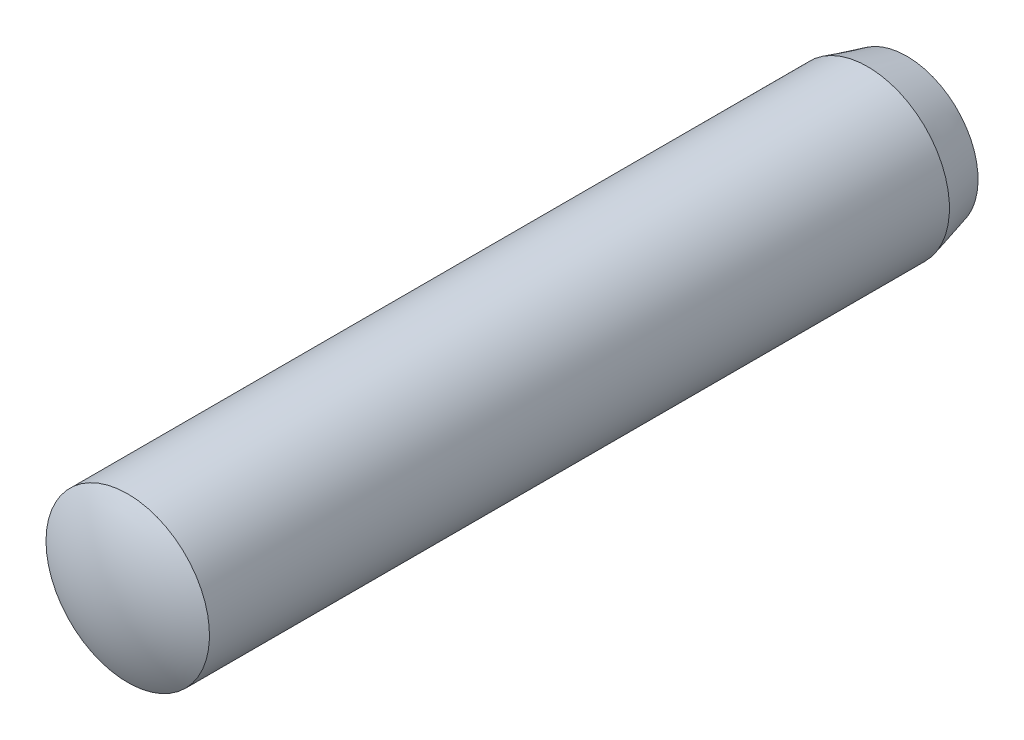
from build123d import *


with BuildPart() as part:
    # Esquisse1 → R_volution1 (revolve)
    with BuildSketch(Plane(origin=(0, 0, 0), x_dir=(0, 0, -1), z_dir=(1, 0, 0))):
        with BuildLine():
            Line((1.07179677, 4), (37.285902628, 4))
            Line((37.285902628, 4), (39.2, 3.487119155))
            ThreePointArc((39.2, 3.487119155), (39.797435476, 1.788854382), (40, 0))
            Line((40, 0), (0, 0))
            ThreePointArc((0, 0), (0.27259339, 2.070552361), (1.07179677, 4))
        make_face()
    revolve(axis=Axis((0, 0, -40), (0, 0, 1)))


solid = part.part
